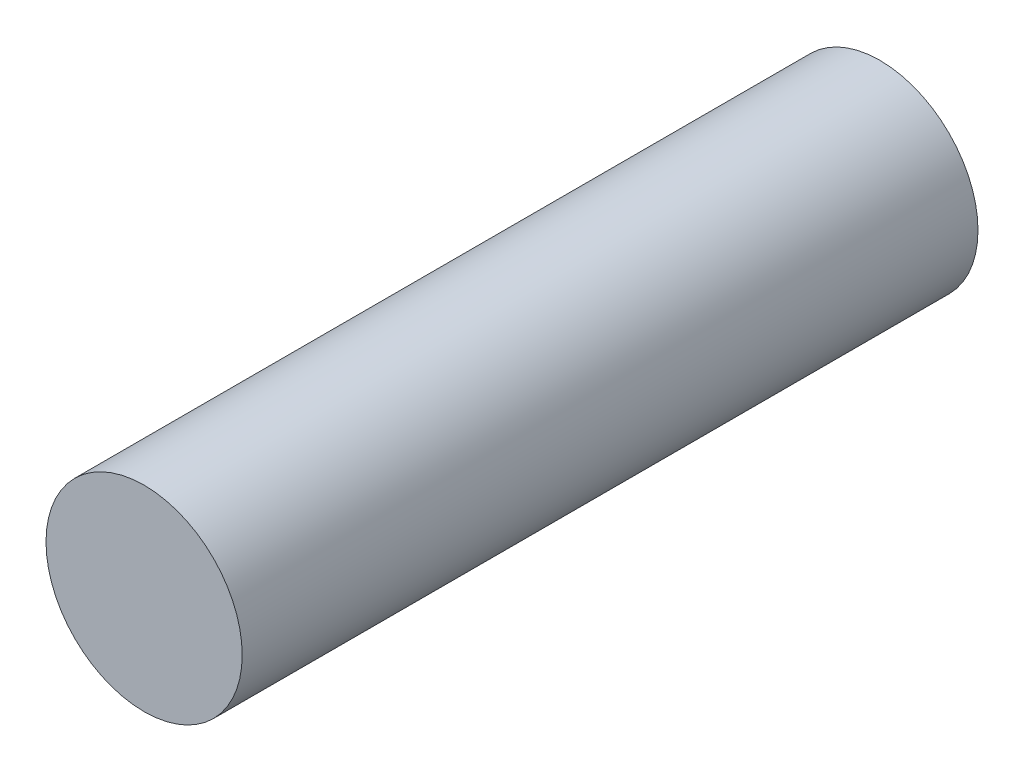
ISO-10303-21;
HEADER;
FILE_DESCRIPTION(('STEP AP214'),'2;1');
FILE_NAME('part.step','',(''),(''),'','','');
FILE_SCHEMA(('AUTOMOTIVE_DESIGN { 1 0 10303 214 1 1 1 1 }'));
ENDSEC;
DATA;
#1=APPLICATION_CONTEXT('core data for automotive mechanical design processes');
#2=APPLICATION_PROTOCOL_DEFINITION('international standard','automotive_design',2000,#1);
#3=PRODUCT_CONTEXT('',#1,'mechanical');
#4=PRODUCT('Part','Part','',(#3));
#5=PRODUCT_RELATED_PRODUCT_CATEGORY('part','',(#4));
#6=PRODUCT_DEFINITION_FORMATION('','',#4);
#7=PRODUCT_DEFINITION_CONTEXT('part definition',#1,'design');
#8=PRODUCT_DEFINITION('design','',#6,#7);
#9=PRODUCT_DEFINITION_SHAPE('','',#8);
#10=(LENGTH_UNIT() NAMED_UNIT(*) SI_UNIT(.MILLI.,.METRE.));
#11=(NAMED_UNIT(*) PLANE_ANGLE_UNIT() SI_UNIT($,.RADIAN.));
#12=(NAMED_UNIT(*) SI_UNIT($,.STERADIAN.) SOLID_ANGLE_UNIT());
#13=UNCERTAINTY_MEASURE_WITH_UNIT(LENGTH_MEASURE(1.E-05),#10,'distance_accuracy_value','');
#14=(GEOMETRIC_REPRESENTATION_CONTEXT(3) GLOBAL_UNCERTAINTY_ASSIGNED_CONTEXT((#13)) GLOBAL_UNIT_ASSIGNED_CONTEXT((#10,
#11,#12)) REPRESENTATION_CONTEXT('',''));
#15=CARTESIAN_POINT('',(0.,0.,0.));
#16=DIRECTION('',(0.,0.,1.));
#17=DIRECTION('',(1.,0.,0.));
#18=AXIS2_PLACEMENT_3D('',#15,#16,#17);
#19=CARTESIAN_POINT('',(0.,0.,75.));
#20=DIRECTION('',(0.,0.,-1.));
#21=DIRECTION('',(-1.,0.,0.));
#22=AXIS2_PLACEMENT_3D('',#19,#20,#21);
#23=CYLINDRICAL_SURFACE('',#22,20.);
#24=CARTESIAN_POINT('',(0.,0.,75.));
#25=DIRECTION('',(0.,0.,1.));
#26=DIRECTION('',(1.,0.,0.));
#27=AXIS2_PLACEMENT_3D('',#24,#25,#26);
#28=CIRCLE('',#27,20.);
#29=CARTESIAN_POINT('',(20.,0.,75.));
#30=VERTEX_POINT('',#29);
#31=EDGE_CURVE('E10',#30,#30,#28,.T.);
#32=ORIENTED_EDGE('',*,*,#31,.F.);
#33=EDGE_LOOP('',(#32));
#34=FACE_BOUND('',#33,.T.);
#35=CARTESIAN_POINT('',(0.,0.,-75.));
#36=DIRECTION('',(0.,0.,1.));
#37=DIRECTION('',(1.,0.,0.));
#38=AXIS2_PLACEMENT_3D('',#35,#36,#37);
#39=CIRCLE('',#38,20.);
#40=CARTESIAN_POINT('',(20.,0.,-75.));
#41=VERTEX_POINT('',#40);
#42=EDGE_CURVE('E46',#41,#41,#39,.T.);
#43=ORIENTED_EDGE('',*,*,#42,.T.);
#44=EDGE_LOOP('',(#43));
#45=FACE_BOUND('',#44,.T.);
#46=ADVANCED_FACE('F43',(#34,#45),#23,.T.);
#47=CARTESIAN_POINT('',(0.,0.,75.));
#48=DIRECTION('',(0.,0.,1.));
#49=DIRECTION('',(1.,0.,0.));
#50=AXIS2_PLACEMENT_3D('',#47,#48,#49);
#51=PLANE('',#50);
#52=ORIENTED_EDGE('',*,*,#31,.T.);
#53=EDGE_LOOP('',(#52));
#54=FACE_BOUND('',#53,.T.);
#55=ADVANCED_FACE('F60',(#54),#51,.T.);
#56=CARTESIAN_POINT('',(0.,0.,-75.));
#57=DIRECTION('',(0.,0.,1.));
#58=DIRECTION('',(1.,0.,0.));
#59=AXIS2_PLACEMENT_3D('',#56,#57,#58);
#60=PLANE('',#59);
#61=ORIENTED_EDGE('',*,*,#42,.F.);
#62=EDGE_LOOP('',(#61));
#63=FACE_BOUND('',#62,.T.);
#64=ADVANCED_FACE('F58',(#63),#60,.F.);
#65=CLOSED_SHELL('',(#46,#55,#64));
#66=MANIFOLD_SOLID_BREP('B2',#65);
#67=ADVANCED_BREP_SHAPE_REPRESENTATION('',(#18,#66),#14);
#68=SHAPE_DEFINITION_REPRESENTATION(#9,#67);
ENDSEC;
END-ISO-10303-21;
